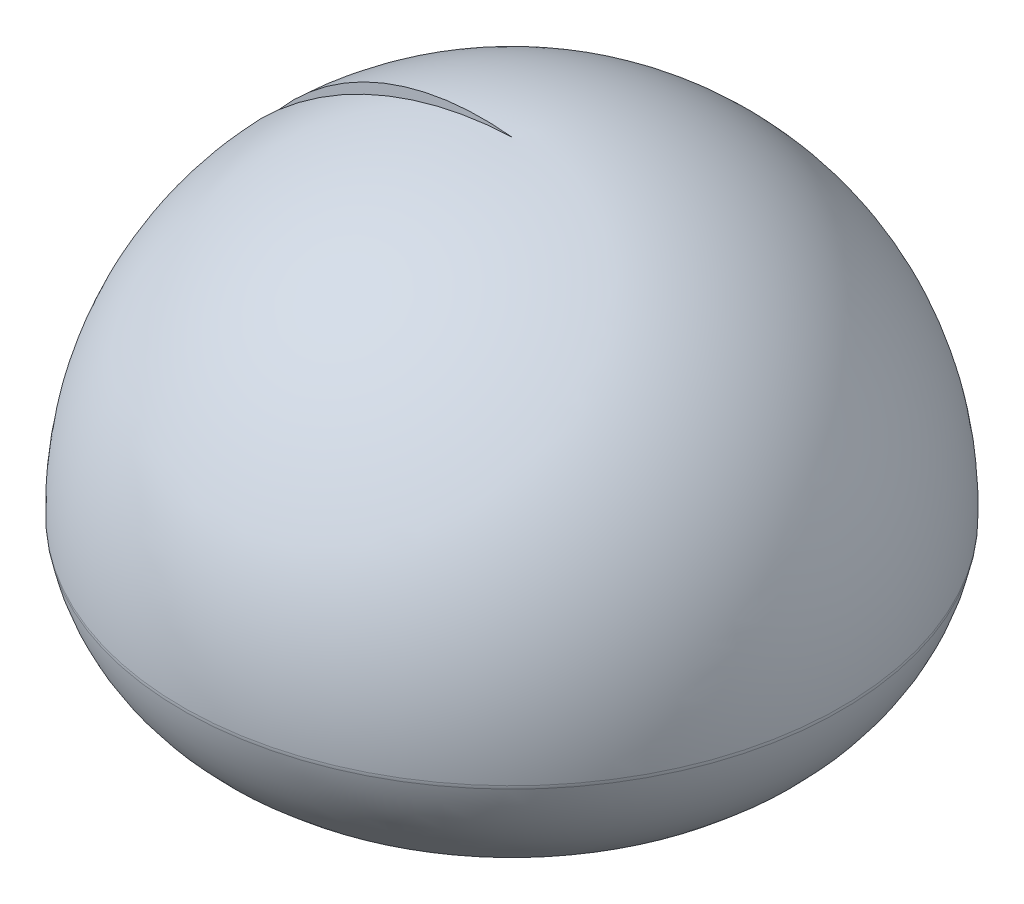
ISO-10303-21;
HEADER;
FILE_DESCRIPTION(('STEP AP214'),'2;1');
FILE_NAME('part.step','',(''),(''),'','','');
FILE_SCHEMA(('AUTOMOTIVE_DESIGN { 1 0 10303 214 1 1 1 1 }'));
ENDSEC;
DATA;
#1=APPLICATION_CONTEXT('core data for automotive mechanical design processes');
#2=APPLICATION_PROTOCOL_DEFINITION('international standard','automotive_design',2000,#1);
#3=PRODUCT_CONTEXT('',#1,'mechanical');
#4=PRODUCT('Part','Part','',(#3));
#5=PRODUCT_RELATED_PRODUCT_CATEGORY('part','',(#4));
#6=PRODUCT_DEFINITION_FORMATION('','',#4);
#7=PRODUCT_DEFINITION_CONTEXT('part definition',#1,'design');
#8=PRODUCT_DEFINITION('design','',#6,#7);
#9=PRODUCT_DEFINITION_SHAPE('','',#8);
#10=(LENGTH_UNIT() NAMED_UNIT(*) SI_UNIT(.MILLI.,.METRE.));
#11=(NAMED_UNIT(*) PLANE_ANGLE_UNIT() SI_UNIT($,.RADIAN.));
#12=(NAMED_UNIT(*) SI_UNIT($,.STERADIAN.) SOLID_ANGLE_UNIT());
#13=UNCERTAINTY_MEASURE_WITH_UNIT(LENGTH_MEASURE(1.E-05),#10,'distance_accuracy_value','');
#14=(GEOMETRIC_REPRESENTATION_CONTEXT(3) GLOBAL_UNCERTAINTY_ASSIGNED_CONTEXT((#13)) GLOBAL_UNIT_ASSIGNED_CONTEXT((#10,
#11,#12)) REPRESENTATION_CONTEXT('',''));
#15=CARTESIAN_POINT('',(0.,0.,0.));
#16=DIRECTION('',(0.,0.,1.));
#17=DIRECTION('',(1.,0.,0.));
#18=AXIS2_PLACEMENT_3D('',#15,#16,#17);
#19=CARTESIAN_POINT('',(0.,385.,25.05));
#20=DIRECTION('',(-1.,0.,0.));
#21=DIRECTION('',(0.,0.,1.));
#22=AXIS2_PLACEMENT_3D('',#19,#20,#21);
#23=CIRCLE('',#22,879.94262394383);
#24=TRIMMED_CURVE('',#23,(PARAMETER_VALUE(-1.59926793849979)),
(PARAMETER_VALUE(1.59926793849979)),.T.,.PARAMETER.);
#25=CARTESIAN_POINT('',(0.,385.,0.));
#26=DIRECTION('',(0.,1.,0.));
#27=AXIS1_PLACEMENT('',#25,#26);
#28=SURFACE_OF_REVOLUTION('',#24,#27);
#29=CARTESIAN_POINT('',(-24.9889794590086,385.,-1.74739966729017));
#30=DIRECTION('',(0.0697564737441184,0.,-0.997564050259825));
#31=DIRECTION('',(-0.997564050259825,0.,-0.0697564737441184));
#32=AXIS2_PLACEMENT_3D('',#29,#30,#31);
#33=CIRCLE('',#32,879.94262394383);
#34=CARTESIAN_POINT('',(-902.494441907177,362.240542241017,-63.1085591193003));
#35=VERTEX_POINT('',#34);
#36=CARTESIAN_POINT('',(0.,1264.5859929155,0.));
#37=VERTEX_POINT('',#36);
#38=EDGE_CURVE('E110',#35,#37,#33,.T.);
#39=ORIENTED_EDGE('',*,*,#38,.T.);
#40=CARTESIAN_POINT('',(-24.9889794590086,385.,1.74739966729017));
#41=DIRECTION('',(-0.0697564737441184,0.,-0.997564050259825));
#42=DIRECTION('',(-0.997564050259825,0.,0.0697564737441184));
#43=AXIS2_PLACEMENT_3D('',#40,#41,#42);
#44=CIRCLE('',#43,879.94262394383);
#45=CARTESIAN_POINT('',(-902.494441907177,362.240542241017,63.1085591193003));
#46=VERTEX_POINT('',#45);
#47=EDGE_CURVE('E128',#46,#37,#44,.T.);
#48=ORIENTED_EDGE('',*,*,#47,.F.);
#49=CARTESIAN_POINT('',(0.,362.240542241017,0.));
#50=DIRECTION('',(0.,1.,0.));
#51=DIRECTION('',(0.,0.,1.));
#52=AXIS2_PLACEMENT_3D('',#49,#50,#51);
#53=CIRCLE('',#52,904.698241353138);
#54=EDGE_CURVE('E51',#46,#35,#53,.T.);
#55=ORIENTED_EDGE('',*,*,#54,.T.);
#56=EDGE_LOOP('',(#39,#48,#55));
#57=FACE_BOUND('',#56,.T.);
#58=ADVANCED_FACE('F36',(#57),#28,.T.);
#59=CARTESIAN_POINT('',(0.,778.06419649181,-80.2712340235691));
#60=DIRECTION('',(-1.,0.,0.));
#61=DIRECTION('',(0.,0.,1.));
#62=AXIS2_PLACEMENT_3D('',#59,#60,#61);
#63=CIRCLE('',#62,406.812057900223);
#64=TRIMMED_CURVE('',#63,(PARAMETER_VALUE(-1.37217521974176)),
(PARAMETER_VALUE(1.37217521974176)),.T.,.PARAMETER.);
#65=CARTESIAN_POINT('',(0.,778.06419649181,0.));
#66=DIRECTION('',(0.,1.,0.));
#67=AXIS1_PLACEMENT('',#65,#66);
#68=SURFACE_OF_REVOLUTION('',#64,#67);
#69=CARTESIAN_POINT('',(0.,591.276284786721,0.));
#70=DIRECTION('',(0.,1.,0.));
#71=DIRECTION('',(0.,0.,1.));
#72=AXIS2_PLACEMENT_3D('',#69,#70,#71);
#73=CIRCLE('',#72,281.123738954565);
#74=CARTESIAN_POINT('',(-280.438935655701,591.276284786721,19.6102007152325));
#75=VERTEX_POINT('',#74);
#76=CARTESIAN_POINT('',(-280.438935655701,591.276284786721,-19.6102007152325));
#77=VERTEX_POINT('',#76);
#78=EDGE_CURVE('E11',#75,#77,#73,.T.);
#79=ORIENTED_EDGE('',*,*,#78,.F.);
#80=CARTESIAN_POINT('',(80.0756973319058,778.06419649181,-5.59943822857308));
#81=DIRECTION('',(0.0697564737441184,0.,0.997564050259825));
#82=DIRECTION('',(-0.997564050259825,0.,0.0697564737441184));
#83=AXIS2_PLACEMENT_3D('',#80,#81,#82);
#84=CIRCLE('',#83,406.812057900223);
#85=CARTESIAN_POINT('',(0.,1176.87816244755,0.));
#86=VERTEX_POINT('',#85);
#87=EDGE_CURVE('E107',#86,#75,#84,.T.);
#88=ORIENTED_EDGE('',*,*,#87,.F.);
#89=CARTESIAN_POINT('',(80.0756973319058,778.06419649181,5.59943822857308));
#90=DIRECTION('',(-0.0697564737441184,0.,0.997564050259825));
#91=DIRECTION('',(-0.997564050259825,0.,-0.0697564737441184));
#92=AXIS2_PLACEMENT_3D('',#89,#90,#91);
#93=CIRCLE('',#92,406.812057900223);
#94=EDGE_CURVE('E106',#86,#77,#93,.T.);
#95=ORIENTED_EDGE('',*,*,#94,.T.);
#96=EDGE_LOOP('',(#79,#88,#95));
#97=FACE_BOUND('',#96,.T.);
#98=ADVANCED_FACE('F38',(#97),#68,.F.);
#99=CARTESIAN_POINT('',(0.,620.354315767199,0.));
#100=DIRECTION('',(0.,1.,0.));
#101=DIRECTION('',(0.,0.,1.));
#102=AXIS2_PLACEMENT_3D('',#99,#100,#101);
#103=TOROIDAL_SURFACE('',#102,324.233692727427,52.0000000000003);
#104=CARTESIAN_POINT('',(0.,588.203831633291,0.));
#105=DIRECTION('',(0.,1.,0.));
#106=DIRECTION('',(0.,0.,1.));
#107=AXIS2_PLACEMENT_3D('',#104,#105,#106);
#108=CIRCLE('',#107,283.363821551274);
#109=CARTESIAN_POINT('',(-282.673561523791,588.203831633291,19.7664609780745));
#110=VERTEX_POINT('',#109);
#111=CARTESIAN_POINT('',(-282.673561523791,588.203831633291,-19.7664609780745));
#112=VERTEX_POINT('',#111);
#113=EDGE_CURVE('E44',#110,#112,#108,.T.);
#114=ORIENTED_EDGE('',*,*,#113,.F.);
#115=CARTESIAN_POINT('',(-323.443875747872,620.354315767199,22.6173990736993));
#116=DIRECTION('',(-0.0697564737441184,0.,-0.997564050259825));
#117=DIRECTION('',(-0.997564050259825,0.,0.0697564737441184));
#118=AXIS2_PLACEMENT_3D('',#115,#116,#117);
#119=CIRCLE('',#118,52.0000000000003);
#120=EDGE_CURVE('E102',#75,#110,#119,.T.);
#121=ORIENTED_EDGE('',*,*,#120,.F.);
#122=ORIENTED_EDGE('',*,*,#78,.T.);
#123=CARTESIAN_POINT('',(-323.443875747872,620.354315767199,-22.6173990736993));
#124=DIRECTION('',(0.0697564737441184,0.,-0.997564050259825));
#125=DIRECTION('',(-0.997564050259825,0.,-0.0697564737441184));
#126=AXIS2_PLACEMENT_3D('',#123,#124,#125);
#127=CIRCLE('',#126,52.0000000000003);
#128=EDGE_CURVE('E99',#77,#112,#127,.T.);
#129=ORIENTED_EDGE('',*,*,#128,.T.);
#130=EDGE_LOOP('',(#114,#121,#122,#129));
#131=FACE_BOUND('',#130,.T.);
#132=ADVANCED_FACE('F97',(#131),#103,.T.);
#133=CARTESIAN_POINT('',(0.,385.,0.));
#134=DIRECTION('',(0.,1.,0.));
#135=DIRECTION('',(0.,0.,1.));
#136=AXIS2_PLACEMENT_3D('',#133,#134,#135);
#137=DEGENERATE_TOROIDAL_SURFACE('',#136,25.05,328.660657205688,.T.);
#138=CARTESIAN_POINT('',(0.,106.860664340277,0.));
#139=DIRECTION('',(0.,1.,0.));
#140=DIRECTION('',(0.,0.,1.));
#141=AXIS2_PLACEMENT_3D('',#138,#139,#140);
#142=CIRCLE('',#141,200.139512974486);
#143=CARTESIAN_POINT('',(-199.651983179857,106.860664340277,13.9610266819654));
#144=VERTEX_POINT('',#143);
#145=CARTESIAN_POINT('',(-199.651983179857,106.860664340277,-13.9610266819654));
#146=VERTEX_POINT('',#145);
#147=EDGE_CURVE('E150',#144,#146,#142,.T.);
#148=ORIENTED_EDGE('',*,*,#147,.F.);
#149=CARTESIAN_POINT('',(-24.9889794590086,385.,1.74739966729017));
#150=DIRECTION('',(0.0697564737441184,0.,0.997564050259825));
#151=DIRECTION('',(-0.997564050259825,0.,0.0697564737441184));
#152=AXIS2_PLACEMENT_3D('',#149,#150,#151);
#153=CIRCLE('',#152,328.660657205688);
#154=EDGE_CURVE('E135',#110,#144,#153,.T.);
#155=ORIENTED_EDGE('',*,*,#154,.F.);
#156=ORIENTED_EDGE('',*,*,#113,.T.);
#157=CARTESIAN_POINT('',(-24.9889794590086,385.,-1.74739966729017));
#158=DIRECTION('',(-0.0697564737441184,0.,0.997564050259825));
#159=DIRECTION('',(-0.997564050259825,0.,-0.0697564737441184));
#160=AXIS2_PLACEMENT_3D('',#157,#158,#159);
#161=CIRCLE('',#160,328.660657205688);
#162=EDGE_CURVE('E116',#112,#146,#161,.T.);
#163=ORIENTED_EDGE('',*,*,#162,.T.);
#164=EDGE_LOOP('',(#148,#155,#156,#163));
#165=FACE_BOUND('',#164,.T.);
#166=ADVANCED_FACE('F153',(#165),#137,.F.);
#167=CARTESIAN_POINT('',(0.,62.8540418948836,0.));
#168=DIRECTION('',(0.,1.,0.));
#169=DIRECTION('',(0.,0.,1.));
#170=AXIS2_PLACEMENT_3D('',#167,#168,#169);
#171=TOROIDAL_SURFACE('',#170,227.841808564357,52.0000000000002);
#172=CARTESIAN_POINT('',(0.,16.6459457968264,0.));
#173=DIRECTION('',(0.,1.,0.));
#174=DIRECTION('',(0.,0.,1.));
#175=AXIS2_PLACEMENT_3D('',#172,#173,#174);
#176=CIRCLE('',#175,203.992031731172);
#177=CARTESIAN_POINT('',(-203.495117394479,16.6459457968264,14.2297648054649));
#178=VERTEX_POINT('',#177);
#179=CARTESIAN_POINT('',(-203.495117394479,16.6459457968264,-14.2297648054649));
#180=VERTEX_POINT('',#179);
#181=EDGE_CURVE('E148',#178,#180,#176,.T.);
#182=ORIENTED_EDGE('',*,*,#181,.F.);
#183=CARTESIAN_POINT('',(-227.286797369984,62.8540418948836,15.893441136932));
#184=DIRECTION('',(-0.0697564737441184,0.,-0.997564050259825));
#185=DIRECTION('',(-0.997564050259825,0.,0.0697564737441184));
#186=AXIS2_PLACEMENT_3D('',#183,#184,#185);
#187=CIRCLE('',#186,52.0000000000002);
#188=EDGE_CURVE('E138',#144,#178,#187,.T.);
#189=ORIENTED_EDGE('',*,*,#188,.F.);
#190=ORIENTED_EDGE('',*,*,#147,.T.);
#191=CARTESIAN_POINT('',(-227.286797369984,62.8540418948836,-15.893441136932));
#192=DIRECTION('',(0.0697564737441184,0.,-0.997564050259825));
#193=DIRECTION('',(-0.997564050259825,0.,-0.0697564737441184));
#194=AXIS2_PLACEMENT_3D('',#191,#192,#193);
#195=CIRCLE('',#194,52.0000000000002);
#196=EDGE_CURVE('E118',#146,#180,#195,.T.);
#197=ORIENTED_EDGE('',*,*,#196,.T.);
#198=EDGE_LOOP('',(#182,#189,#190,#197));
#199=FACE_BOUND('',#198,.T.);
#200=ADVANCED_FACE('F164',(#199),#171,.T.);
#201=CARTESIAN_POINT('',(0.,448.65787685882,0.));
#202=DIRECTION('',(0.,1.,0.));
#203=DIRECTION('',(0.,0.,1.));
#204=AXIS2_PLACEMENT_3D('',#201,#202,#203);
#205=DEGENERATE_TOROIDAL_SURFACE('',#204,426.97001643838,486.162,.T.);
#206=CARTESIAN_POINT('',(0.,353.396307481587,0.));
#207=DIRECTION('',(0.,1.,0.));
#208=DIRECTION('',(0.,0.,1.));
#209=AXIS2_PLACEMENT_3D('',#206,#207,#208);
#210=CIRCLE('',#209,903.707600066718);
#211=CARTESIAN_POINT('',(-901.506213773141,353.396307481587,63.0394554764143));
#212=VERTEX_POINT('',#211);
#213=CARTESIAN_POINT('',(-901.506213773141,353.396307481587,-63.0394554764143));
#214=VERTEX_POINT('',#213);
#215=EDGE_CURVE('E59',#212,#214,#210,.T.);
#216=ORIENTED_EDGE('',*,*,#215,.F.);
#217=CARTESIAN_POINT('',(-425.929938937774,448.65787685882,29.7839227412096));
#218=DIRECTION('',(-0.0697564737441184,0.,-0.997564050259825));
#219=DIRECTION('',(-0.997564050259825,0.,0.0697564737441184));
#220=AXIS2_PLACEMENT_3D('',#217,#218,#219);
#221=CIRCLE('',#220,486.162);
#222=EDGE_CURVE('E141',#178,#212,#221,.T.);
#223=ORIENTED_EDGE('',*,*,#222,.F.);
#224=ORIENTED_EDGE('',*,*,#181,.T.);
#225=CARTESIAN_POINT('',(-425.929938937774,448.65787685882,-29.7839227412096));
#226=DIRECTION('',(0.0697564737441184,0.,-0.997564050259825));
#227=DIRECTION('',(-0.997564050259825,0.,-0.0697564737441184));
#228=AXIS2_PLACEMENT_3D('',#225,#226,#227);
#229=CIRCLE('',#228,486.162);
#230=EDGE_CURVE('E124',#180,#214,#229,.T.);
#231=ORIENTED_EDGE('',*,*,#230,.T.);
#232=EDGE_LOOP('',(#216,#223,#224,#231));
#233=FACE_BOUND('',#232,.T.);
#234=ADVANCED_FACE('F162',(#233),#205,.T.);
#235=CARTESIAN_POINT('',(0.,363.585506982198,0.));
#236=DIRECTION('',(0.,1.,0.));
#237=DIRECTION('',(0.,0.,1.));
#238=AXIS2_PLACEMENT_3D('',#235,#236,#237);
#239=TOROIDAL_SURFACE('',#238,852.715637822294,51.9999999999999);
#240=CARTESIAN_POINT('',(-850.638465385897,363.585506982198,59.4824360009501));
#241=DIRECTION('',(-0.0697564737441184,0.,-0.997564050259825));
#242=DIRECTION('',(-0.997564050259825,0.,0.0697564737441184));
#243=AXIS2_PLACEMENT_3D('',#240,#241,#242);
#244=CIRCLE('',#243,51.9999999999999);
#245=EDGE_CURVE('E143',#212,#46,#244,.T.);
#246=ORIENTED_EDGE('',*,*,#245,.F.);
#247=ORIENTED_EDGE('',*,*,#215,.T.);
#248=CARTESIAN_POINT('',(-850.638465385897,363.585506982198,-59.4824360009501));
#249=DIRECTION('',(0.0697564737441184,0.,-0.997564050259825));
#250=DIRECTION('',(-0.997564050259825,0.,-0.0697564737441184));
#251=AXIS2_PLACEMENT_3D('',#248,#249,#250);
#252=CIRCLE('',#251,51.9999999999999);
#253=EDGE_CURVE('E126',#214,#35,#252,.T.);
#254=ORIENTED_EDGE('',*,*,#253,.T.);
#255=ORIENTED_EDGE('',*,*,#54,.F.);
#256=EDGE_LOOP('',(#246,#247,#254,#255));
#257=FACE_BOUND('',#256,.T.);
#258=ADVANCED_FACE('F160',(#257),#239,.T.);
#259=CARTESIAN_POINT('',(-24.9889794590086,385.,1.74739966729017));
#260=DIRECTION('',(-0.0697564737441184,0.,-0.997564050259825));
#261=DIRECTION('',(-0.997564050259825,0.,0.0697564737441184));
#262=AXIS2_PLACEMENT_3D('',#259,#260,#261);
#263=PLANE('',#262);
#264=ORIENTED_EDGE('',*,*,#47,.T.);
#265=DIRECTION('',(0.,-1.,0.));
#266=VECTOR('',#265,1.);
#267=CARTESIAN_POINT('',(0.,1176.87816244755,0.));
#268=LINE('',#267,#266);
#269=EDGE_CURVE('E131',#37,#86,#268,.T.);
#270=ORIENTED_EDGE('',*,*,#269,.T.);
#271=ORIENTED_EDGE('',*,*,#87,.T.);
#272=ORIENTED_EDGE('',*,*,#120,.T.);
#273=ORIENTED_EDGE('',*,*,#154,.T.);
#274=ORIENTED_EDGE('',*,*,#188,.T.);
#275=ORIENTED_EDGE('',*,*,#222,.T.);
#276=ORIENTED_EDGE('',*,*,#245,.T.);
#277=EDGE_LOOP('',(#264,#270,#271,#272,#273,#274,#275,#276));
#278=FACE_BOUND('',#277,.T.);
#279=ADVANCED_FACE('F155',(#278),#263,.T.);
#280=CARTESIAN_POINT('',(-24.9889794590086,385.,-1.74739966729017));
#281=DIRECTION('',(0.0697564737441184,0.,-0.997564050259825));
#282=DIRECTION('',(-0.997564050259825,0.,-0.0697564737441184));
#283=AXIS2_PLACEMENT_3D('',#280,#281,#282);
#284=PLANE('',#283);
#285=ORIENTED_EDGE('',*,*,#38,.F.);
#286=ORIENTED_EDGE('',*,*,#253,.F.);
#287=ORIENTED_EDGE('',*,*,#230,.F.);
#288=ORIENTED_EDGE('',*,*,#196,.F.);
#289=ORIENTED_EDGE('',*,*,#162,.F.);
#290=ORIENTED_EDGE('',*,*,#128,.F.);
#291=ORIENTED_EDGE('',*,*,#94,.F.);
#292=ORIENTED_EDGE('',*,*,#269,.F.);
#293=EDGE_LOOP('',(#285,#286,#287,#288,#289,#290,#291,#292));
#294=FACE_BOUND('',#293,.T.);
#295=ADVANCED_FACE('F113',(#294),#284,.F.);
#296=CLOSED_SHELL('',(#58,#98,#132,#166,#200,#234,#258,#279,#295));
#297=MANIFOLD_SOLID_BREP('B2',#296);
#298=ADVANCED_BREP_SHAPE_REPRESENTATION('',(#18,#297),#14);
#299=SHAPE_DEFINITION_REPRESENTATION(#9,#298);
ENDSEC;
END-ISO-10303-21;
